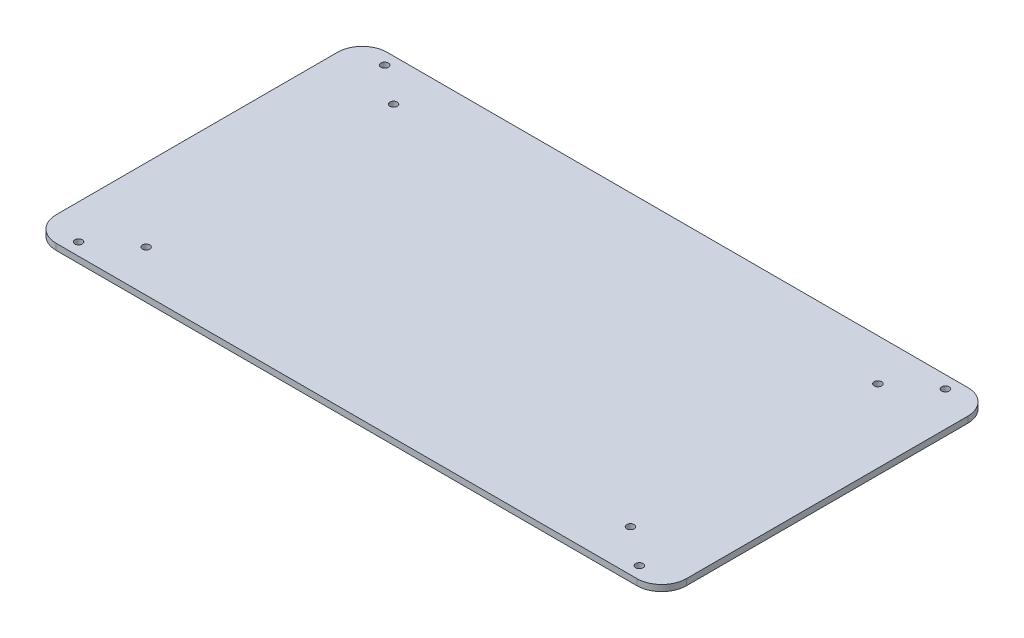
from build123d import *

# Parameters (mm, degrees)
SKETCH1_W               = 254
SKETCH1_H               = 133.35
BOSS_EXTRUDE1_DEPTH     = 2.5
FILLET1_R               = 10
CUT_EXTRUDE4_DEPTH      = 8
CUT_EXTRUDE4_DEPTH_BACK = 4.5
SKETCH2_R               = 1.5
SKETCH3_R               = 1.5
CUT_EXTRUDE5_DEPTH      = 10


with BuildPart() as part:
    # Sketch1 → Boss-Extrude1 (new body)
    with BuildSketch(Plane(origin=(0, 0, 0), x_dir=(1, 0, 0), z_dir=(0, 1, 0))):
        Rectangle(SKETCH1_W, SKETCH1_H)
    extrude(amount=BOSS_EXTRUDE1_DEPTH)

    # Fillet1
    fillet1_edges = [part.edges().sort_by_distance(p)[0] for p in [
        (127, 1.25, 66.675),
        (-127, 1.25, 66.675),
        (-127, 1.25, -66.675),
        (127, 1.25, -66.675),
    ]]
    fillet(fillet1_edges, radius=FILLET1_R)

    # Sketch2 → Cut-Extrude4 (cut, two sides: drawn at the far end of the back side and taken through both)
    with BuildSketch(Plane(origin=(0, 0, 0), x_dir=(1, 0, 0), z_dir=(0, 1, 0)).offset(-CUT_EXTRUDE4_DEPTH_BACK)):
        with Locations(Location((-113, 61.675, 0), (0, 0, 270))):
            Circle(SKETCH2_R)
        with Locations(Location((-113, -61.675, 0), (0, 0, 270))):
            Circle(SKETCH2_R)
        with Locations(Location((113, 61.675, 0), (0, 0, 270))):
            Circle(SKETCH2_R)
        with Locations(Location((113, -61.675, 0), (0, 0, 270))):
            Circle(SKETCH2_R)
    extrude(amount=CUT_EXTRUDE4_DEPTH + CUT_EXTRUDE4_DEPTH_BACK, mode=Mode.SUBTRACT)

    # Sketch3 → Cut-Extrude5 (cut)
    with BuildSketch(Plane(origin=(0, 2.5, 0), x_dir=(1, 0, 0), z_dir=(0, 1, 0))):
        with Locations(Location((97.597013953, 49.859644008, 0), (0, 0, 270))):
            Circle(SKETCH3_R)
        with Locations(Location((97.597013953, -49.859644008, 0), (0, 0, 270))):
            Circle(SKETCH3_R)
        with Locations(Location((-97.597013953, 49.859644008, 0), (0, 0, 270))):
            Circle(SKETCH3_R)
        with Locations(Location((-97.597013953, -49.859644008, 0), (0, 0, 270))):
            Circle(SKETCH3_R)
    extrude(amount=-CUT_EXTRUDE5_DEPTH, mode=Mode.SUBTRACT)


solid = part.part
